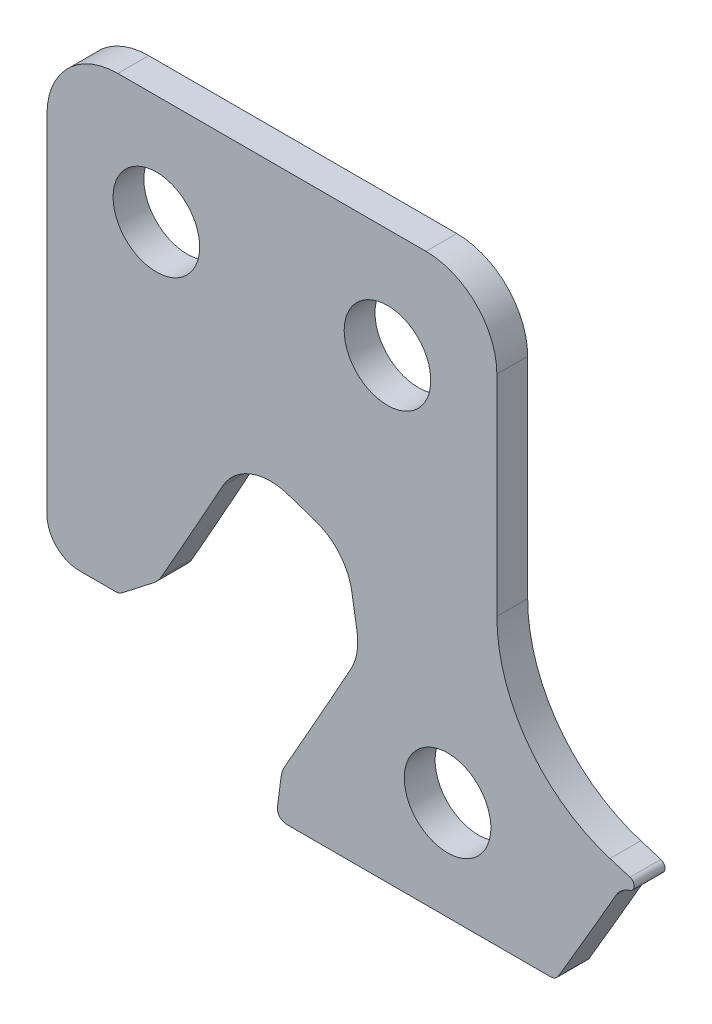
ISO-10303-21;
HEADER;
FILE_DESCRIPTION(('STEP AP214'),'2;1');
FILE_NAME('part.step','',(''),(''),'','','');
FILE_SCHEMA(('AUTOMOTIVE_DESIGN { 1 0 10303 214 1 1 1 1 }'));
ENDSEC;
DATA;
#1=APPLICATION_CONTEXT('core data for automotive mechanical design processes');
#2=APPLICATION_PROTOCOL_DEFINITION('international standard','automotive_design',2000,#1);
#3=PRODUCT_CONTEXT('',#1,'mechanical');
#4=PRODUCT('Part','Part','',(#3));
#5=PRODUCT_RELATED_PRODUCT_CATEGORY('part','',(#4));
#6=PRODUCT_DEFINITION_FORMATION('','',#4);
#7=PRODUCT_DEFINITION_CONTEXT('part definition',#1,'design');
#8=PRODUCT_DEFINITION('design','',#6,#7);
#9=PRODUCT_DEFINITION_SHAPE('','',#8);
#10=(LENGTH_UNIT() NAMED_UNIT(*) SI_UNIT(.MILLI.,.METRE.));
#11=(NAMED_UNIT(*) PLANE_ANGLE_UNIT() SI_UNIT($,.RADIAN.));
#12=(NAMED_UNIT(*) SI_UNIT($,.STERADIAN.) SOLID_ANGLE_UNIT());
#13=UNCERTAINTY_MEASURE_WITH_UNIT(LENGTH_MEASURE(1.E-05),#10,'distance_accuracy_value','');
#14=(GEOMETRIC_REPRESENTATION_CONTEXT(3) GLOBAL_UNCERTAINTY_ASSIGNED_CONTEXT((#13)) GLOBAL_UNIT_ASSIGNED_CONTEXT((#10,
#11,#12)) REPRESENTATION_CONTEXT('',''));
#15=CARTESIAN_POINT('',(0.,0.,0.));
#16=DIRECTION('',(0.,0.,1.));
#17=DIRECTION('',(1.,0.,0.));
#18=AXIS2_PLACEMENT_3D('',#15,#16,#17);
#19=CARTESIAN_POINT('',(-965.862080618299,58.123461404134,-2.54));
#20=DIRECTION('',(0.,0.,1.));
#21=DIRECTION('',(1.,0.,0.));
#22=AXIS2_PLACEMENT_3D('',#19,#20,#21);
#23=PLANE('',#22);
#24=CARTESIAN_POINT('',(-974.344,65.532,-2.54));
#25=DIRECTION('',(0.,0.,-1.));
#26=DIRECTION('',(-1.,0.,0.));
#27=AXIS2_PLACEMENT_3D('',#24,#25,#26);
#28=CIRCLE('',#27,3.56869999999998);
#29=CARTESIAN_POINT('',(-977.9127,65.532,-2.54));
#30=VERTEX_POINT('',#29);
#31=EDGE_CURVE('E490',#30,#30,#28,.T.);
#32=ORIENTED_EDGE('',*,*,#31,.F.);
#33=EDGE_LOOP('',(#32));
#34=FACE_BOUND('',#33,.T.);
#35=CARTESIAN_POINT('',(-979.297000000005,94.996,-2.54));
#36=DIRECTION('',(0.,0.,-1.));
#37=DIRECTION('',(-1.,0.,0.));
#38=AXIS2_PLACEMENT_3D('',#35,#36,#37);
#39=CIRCLE('',#38,3.56869999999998);
#40=CARTESIAN_POINT('',(-982.865700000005,94.996,-2.54));
#41=VERTEX_POINT('',#40);
#42=EDGE_CURVE('E498',#41,#41,#39,.T.);
#43=ORIENTED_EDGE('',*,*,#42,.F.);
#44=EDGE_LOOP('',(#43));
#45=FACE_BOUND('',#44,.T.);
#46=CARTESIAN_POINT('',(-965.862080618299,58.123461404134,-2.54));
#47=DIRECTION('',(0.,0.,1.));
#48=DIRECTION('',(1.,0.,0.));
#49=AXIS2_PLACEMENT_3D('',#46,#47,#48);
#50=CIRCLE('',#49,0.762000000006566);
#51=CARTESIAN_POINT('',(-965.862080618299,57.3614614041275,-2.54));
#52=VERTEX_POINT('',#51);
#53=CARTESIAN_POINT('',(-965.205820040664,57.7362068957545,-2.54));
#54=VERTEX_POINT('',#53);
#55=EDGE_CURVE('E375',#52,#54,#50,.T.);
#56=ORIENTED_EDGE('',*,*,#55,.F.);
#57=DIRECTION('',(1.,0.,0.));
#58=VECTOR('',#57,1.);
#59=CARTESIAN_POINT('',(-987.611398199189,57.3614614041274,-2.54));
#60=LINE('',#59,#58);
#61=CARTESIAN_POINT('',(-987.611398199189,57.3614614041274,-2.54));
#62=VERTEX_POINT('',#61);
#63=EDGE_CURVE('E255',#62,#52,#60,.T.);
#64=ORIENTED_EDGE('',*,*,#63,.F.);
#65=CARTESIAN_POINT('',(-987.611398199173,58.123461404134,-2.54));
#66=DIRECTION('',(0.,0.,1.));
#67=DIRECTION('',(1.,0.,0.));
#68=AXIS2_PLACEMENT_3D('',#65,#66,#67);
#69=CIRCLE('',#68,0.762000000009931);
#70=CARTESIAN_POINT('',(-988.367071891,58.2214474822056,-2.54));
#71=VERTEX_POINT('',#70);
#72=EDGE_CURVE('E239',#71,#62,#69,.T.);
#73=ORIENTED_EDGE('',*,*,#72,.F.);
#74=DIRECTION('',(-0.128590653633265,-0.991697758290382,0.));
#75=VECTOR('',#74,1.);
#76=CARTESIAN_POINT('',(-988.071639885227,60.4998343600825,-2.54));
#77=LINE('',#76,#75);
#78=CARTESIAN_POINT('',(-988.071639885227,60.4998343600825,-2.54));
#79=VERTEX_POINT('',#78);
#80=EDGE_CURVE('E253',#79,#71,#77,.T.);
#81=ORIENTED_EDGE('',*,*,#80,.F.);
#82=CARTESIAN_POINT('',(-985.552727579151,60.17321409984,-2.54));
#83=DIRECTION('',(0.,0.,1.));
#84=DIRECTION('',(1.,0.,0.));
#85=AXIS2_PLACEMENT_3D('',#82,#83,#84);
#86=CIRCLE('',#85,2.54000000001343);
#87=CARTESIAN_POINT('',(-987.757975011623,61.4335647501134,-2.54));
#88=VERTEX_POINT('',#87);
#89=EDGE_CURVE('E260',#88,#79,#86,.T.);
#90=ORIENTED_EDGE('',*,*,#89,.F.);
#91=CARTESIAN_POINT('',(-1733.41846147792,487.596028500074,-2.54));
#92=DIRECTION('',(0.,0.,-1.));
#93=DIRECTION('',(1.,0.,0.));
#94=AXIS2_PLACEMENT_3D('',#91,#92,#93);
#95=CIRCLE('',#94,858.85039825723);
#96=CARTESIAN_POINT('',(-982.309033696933,71.1123744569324,-2.54));
#97=VERTEX_POINT('',#96);
#98=EDGE_CURVE('E264',#97,#88,#95,.T.);
#99=ORIENTED_EDGE('',*,*,#98,.F.);
#100=CARTESIAN_POINT('',(-986.251514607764,73.2984458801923,-2.54));
#101=DIRECTION('',(0.,0.,-1.));
#102=DIRECTION('',(1.,0.,0.));
#103=AXIS2_PLACEMENT_3D('',#100,#101,#102);
#104=CIRCLE('',#103,4.50799999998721);
#105=CARTESIAN_POINT('',(-981.803276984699,74.0300509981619,-2.54));
#106=VERTEX_POINT('',#105);
#107=EDGE_CURVE('E593',#106,#97,#104,.T.);
#108=ORIENTED_EDGE('',*,*,#107,.F.);
#109=DIRECTION('',(0.162290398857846,-0.986743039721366,0.));
#110=VECTOR('',#109,1.);
#111=CARTESIAN_POINT('',(-982.238865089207,76.6784734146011,-2.54));
#112=LINE('',#111,#110);
#113=CARTESIAN_POINT('',(-982.238865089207,76.6784734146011,-2.54));
#114=VERTEX_POINT('',#113);
#115=EDGE_CURVE('E589',#114,#106,#112,.T.);
#116=ORIENTED_EDGE('',*,*,#115,.F.);
#117=CARTESIAN_POINT('',(-986.687102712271,75.9468682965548,-2.54));
#118=DIRECTION('',(0.,0.,-1.));
#119=DIRECTION('',(1.,0.,0.));
#120=AXIS2_PLACEMENT_3D('',#117,#118,#119);
#121=CIRCLE('',#120,4.50799999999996);
#122=CARTESIAN_POINT('',(-985.266924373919,80.2253209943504,-2.54));
#123=VERTEX_POINT('',#122);
#124=EDGE_CURVE('E585',#123,#114,#121,.T.);
#125=ORIENTED_EDGE('',*,*,#124,.F.);
#126=DIRECTION('',(0.949080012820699,-0.315035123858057,0.));
#127=VECTOR('',#126,1.);
#128=CARTESIAN_POINT('',(-987.523168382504,80.974252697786,-2.54));
#129=LINE('',#128,#127);
#130=CARTESIAN_POINT('',(-987.523168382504,80.974252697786,-2.54));
#131=VERTEX_POINT('',#130);
#132=EDGE_CURVE('E581',#131,#123,#129,.T.);
#133=ORIENTED_EDGE('',*,*,#132,.F.);
#134=CARTESIAN_POINT('',(-988.94334672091,76.6958000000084,-2.54));
#135=DIRECTION('',(0.,0.,-1.));
#136=DIRECTION('',(1.,0.,0.));
#137=AXIS2_PLACEMENT_3D('',#134,#135,#136);
#138=CIRCLE('',#137,4.50799999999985);
#139=CARTESIAN_POINT('',(-992.89010255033,78.8741439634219,-2.54));
#140=VERTEX_POINT('',#139);
#141=EDGE_CURVE('E577',#140,#131,#138,.T.);
#142=ORIENTED_EDGE('',*,*,#141,.F.);
#143=CARTESIAN_POINT('',(-1733.41846147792,487.596028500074,-2.54));
#144=DIRECTION('',(0.,0.,1.));
#145=DIRECTION('',(1.,0.,0.));
#146=AXIS2_PLACEMENT_3D('',#143,#144,#145);
#147=CIRCLE('',#146,845.834398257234);
#148=CARTESIAN_POINT('',(-997.92184081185,69.8873378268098,-2.54));
#149=VERTEX_POINT('',#148);
#150=EDGE_CURVE('E573',#149,#140,#147,.T.);
#151=ORIENTED_EDGE('',*,*,#150,.F.);
#152=CARTESIAN_POINT('',(-1000.13050177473,71.1416969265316,-2.54));
#153=DIRECTION('',(0.,0.,1.));
#154=DIRECTION('',(1.,0.,0.));
#155=AXIS2_PLACEMENT_3D('',#152,#153,#154);
#156=CIRCLE('',#155,2.53999999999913);
#157=CARTESIAN_POINT('',(-998.567958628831,69.1391837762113,-2.54));
#158=VERTEX_POINT('',#157);
#159=EDGE_CURVE('E569',#158,#149,#156,.T.);
#160=ORIENTED_EDGE('',*,*,#159,.F.);
#161=DIRECTION('',(0.788391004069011,0.615174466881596,0.));
#162=VECTOR('',#161,1.);
#163=CARTESIAN_POINT('',(-1001.19382194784,67.0902460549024,-2.54));
#164=LINE('',#163,#162);
#165=CARTESIAN_POINT('',(-1001.19382194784,67.0902460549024,-2.54));
#166=VERTEX_POINT('',#165);
#167=EDGE_CURVE('E565',#166,#158,#164,.T.);
#168=ORIENTED_EDGE('',*,*,#167,.F.);
#169=CARTESIAN_POINT('',(-1001.66258489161,67.691,-2.54));
#170=DIRECTION('',(0.,0.,1.));
#171=DIRECTION('',(1.,0.,0.));
#172=AXIS2_PLACEMENT_3D('',#169,#170,#171);
#173=CIRCLE('',#172,0.761999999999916);
#174=CARTESIAN_POINT('',(-1001.66258489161,66.9290000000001,-2.54));
#175=VERTEX_POINT('',#174);
#176=EDGE_CURVE('E561',#175,#166,#173,.T.);
#177=ORIENTED_EDGE('',*,*,#176,.F.);
#178=DIRECTION('',(1.,0.,0.));
#179=VECTOR('',#178,1.);
#180=CARTESIAN_POINT('',(-1004.697,66.929,-2.54));
#181=LINE('',#180,#179);
#182=CARTESIAN_POINT('',(-1004.697,66.929,-2.54));
#183=VERTEX_POINT('',#182);
#184=EDGE_CURVE('E557',#183,#175,#181,.T.);
#185=ORIENTED_EDGE('',*,*,#184,.F.);
#186=CARTESIAN_POINT('',(-1004.697,69.596,-2.54));
#187=DIRECTION('',(0.,0.,1.));
#188=DIRECTION('',(1.,0.,0.));
#189=AXIS2_PLACEMENT_3D('',#186,#187,#188);
#190=CIRCLE('',#189,2.66699999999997);
#191=CARTESIAN_POINT('',(-1007.364,69.596,-2.54));
#192=VERTEX_POINT('',#191);
#193=EDGE_CURVE('E553',#192,#183,#190,.T.);
#194=ORIENTED_EDGE('',*,*,#193,.F.);
#195=DIRECTION('',(0.,-1.,0.));
#196=VECTOR('',#195,1.);
#197=CARTESIAN_POINT('',(-1007.364,98.1709999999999,-2.54));
#198=LINE('',#197,#196);
#199=CARTESIAN_POINT('',(-1007.364,98.1709999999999,-2.54));
#200=VERTEX_POINT('',#199);
#201=EDGE_CURVE('E549',#200,#192,#198,.T.);
#202=ORIENTED_EDGE('',*,*,#201,.F.);
#203=CARTESIAN_POINT('',(-1001.522,98.171,-2.54));
#204=DIRECTION('',(0.,0.,1.));
#205=DIRECTION('',(1.,0.,0.));
#206=AXIS2_PLACEMENT_3D('',#203,#204,#205);
#207=CIRCLE('',#206,5.84200000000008);
#208=CARTESIAN_POINT('',(-1001.522,104.013,-2.54));
#209=VERTEX_POINT('',#208);
#210=EDGE_CURVE('E545',#209,#200,#207,.T.);
#211=ORIENTED_EDGE('',*,*,#210,.F.);
#212=DIRECTION('',(-1.,0.,0.));
#213=VECTOR('',#212,1.);
#214=CARTESIAN_POINT('',(-976.122,104.013,-2.54));
#215=LINE('',#214,#213);
#216=CARTESIAN_POINT('',(-976.122,104.013,-2.54));
#217=VERTEX_POINT('',#216);
#218=EDGE_CURVE('E541',#217,#209,#215,.T.);
#219=ORIENTED_EDGE('',*,*,#218,.F.);
#220=CARTESIAN_POINT('',(-976.122,98.171,-2.54));
#221=DIRECTION('',(0.,0.,1.));
#222=DIRECTION('',(1.,0.,0.));
#223=AXIS2_PLACEMENT_3D('',#220,#221,#222);
#224=CIRCLE('',#223,5.842);
#225=CARTESIAN_POINT('',(-970.28,98.1709999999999,-2.54));
#226=VERTEX_POINT('',#225);
#227=EDGE_CURVE('E537',#226,#217,#224,.T.);
#228=ORIENTED_EDGE('',*,*,#227,.F.);
#229=DIRECTION('',(2.05435062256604E-13,1.,0.));
#230=VECTOR('',#229,1.);
#231=CARTESIAN_POINT('',(-970.280000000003,80.877390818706,-2.54));
#232=LINE('',#231,#230);
#233=CARTESIAN_POINT('',(-970.280000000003,80.877390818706,-2.54));
#234=VERTEX_POINT('',#233);
#235=EDGE_CURVE('E533',#234,#226,#232,.T.);
#236=ORIENTED_EDGE('',*,*,#235,.F.);
#237=CARTESIAN_POINT('',(-957.072,80.8773908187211,-2.54));
#238=DIRECTION('',(0.,0.,-1.));
#239=DIRECTION('',(1.,0.,0.));
#240=AXIS2_PLACEMENT_3D('',#237,#238,#239);
#241=CIRCLE('',#240,13.2080000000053);
#242=CARTESIAN_POINT('',(-960.955669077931,68.2532718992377,-2.54));
#243=VERTEX_POINT('',#242);
#244=EDGE_CURVE('E529',#243,#234,#241,.T.);
#245=ORIENTED_EDGE('',*,*,#244,.F.);
#246=DIRECTION('',(-0.955793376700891,0.294039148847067,0.));
#247=VECTOR('',#246,1.);
#248=CARTESIAN_POINT('',(-959.30460257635,67.7453397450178,-2.54));
#249=LINE('',#248,#247);
#250=CARTESIAN_POINT('',(-959.30460257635,67.7453397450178,-2.54));
#251=VERTEX_POINT('',#250);
#252=EDGE_CURVE('E525',#251,#243,#249,.T.);
#253=ORIENTED_EDGE('',*,*,#252,.F.);
#254=CARTESIAN_POINT('',(-959.44926983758,67.2750894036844,-2.54));
#255=DIRECTION('',(0.,0.,1.));
#256=DIRECTION('',(1.,0.,0.));
#257=AXIS2_PLACEMENT_3D('',#254,#255,#256);
#258=CIRCLE('',#257,0.491999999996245);
#259=CARTESIAN_POINT('',(-959.303437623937,66.8051990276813,-2.54));
#260=VERTEX_POINT('',#259);
#261=EDGE_CURVE('E521',#260,#251,#258,.T.);
#262=ORIENTED_EDGE('',*,*,#261,.F.);
#263=CARTESIAN_POINT('',(-958.70113872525,64.8645135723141,-2.54));
#264=DIRECTION('',(0.,0.,-1.));
#265=DIRECTION('',(1.,0.,0.));
#266=AXIS2_PLACEMENT_3D('',#263,#264,#265);
#267=CIRCLE('',#266,2.03200000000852);
#268=CARTESIAN_POINT('',(-960.462561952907,65.8776336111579,-2.54));
#269=VERTEX_POINT('',#268);
#270=EDGE_CURVE('E517',#269,#260,#267,.T.);
#271=ORIENTED_EDGE('',*,*,#270,.F.);
#272=CARTESIAN_POINT('',(-1693.66746147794,487.596028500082,-2.54));
#273=DIRECTION('',(0.,0.,1.));
#274=DIRECTION('',(1.,0.,0.));
#275=AXIS2_PLACEMENT_3D('',#272,#273,#274);
#276=CIRCLE('',#275,845.834398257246);
#277=EDGE_CURVE('E514',#54,#269,#276,.T.);
#278=ORIENTED_EDGE('',*,*,#277,.F.);
#279=EDGE_LOOP('',(#56,#64,#73,#81,#90,#99,#108,#116,#125,#133,#142,#151,#160,#168,#177,#185,
#194,#202,#211,#219,#228,#236,#245,#253,#262,#271,#278));
#280=FACE_BOUND('',#279,.T.);
#281=CARTESIAN_POINT('',(-998.347,94.996,-2.54));
#282=DIRECTION('',(0.,0.,-1.));
#283=DIRECTION('',(-1.,0.,0.));
#284=AXIS2_PLACEMENT_3D('',#281,#282,#283);
#285=CIRCLE('',#284,3.56869999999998);
#286=CARTESIAN_POINT('',(-1001.9157,94.996,-2.54));
#287=VERTEX_POINT('',#286);
#288=EDGE_CURVE('E275',#287,#287,#285,.T.);
#289=ORIENTED_EDGE('',*,*,#288,.F.);
#290=EDGE_LOOP('',(#289));
#291=FACE_BOUND('',#290,.T.);
#292=ADVANCED_FACE('F51',(#34,#45,#280,#291),#23,.F.);
#293=CARTESIAN_POINT('',(-965.862080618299,58.123461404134,0.));
#294=DIRECTION('',(0.,0.,1.));
#295=DIRECTION('',(1.,0.,0.));
#296=AXIS2_PLACEMENT_3D('',#293,#294,#295);
#297=PLANE('',#296);
#298=CARTESIAN_POINT('',(-974.344,65.532,0.));
#299=DIRECTION('',(0.,0.,-1.));
#300=DIRECTION('',(-1.,0.,0.));
#301=AXIS2_PLACEMENT_3D('',#298,#299,#300);
#302=CIRCLE('',#301,3.56869999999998);
#303=CARTESIAN_POINT('',(-977.9127,65.532,0.));
#304=VERTEX_POINT('',#303);
#305=EDGE_CURVE('E488',#304,#304,#302,.T.);
#306=ORIENTED_EDGE('',*,*,#305,.T.);
#307=EDGE_LOOP('',(#306));
#308=FACE_BOUND('',#307,.T.);
#309=CARTESIAN_POINT('',(-979.297000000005,94.996,0.));
#310=DIRECTION('',(0.,0.,-1.));
#311=DIRECTION('',(-1.,0.,0.));
#312=AXIS2_PLACEMENT_3D('',#309,#310,#311);
#313=CIRCLE('',#312,3.56869999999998);
#314=CARTESIAN_POINT('',(-982.865700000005,94.996,0.));
#315=VERTEX_POINT('',#314);
#316=EDGE_CURVE('E492',#315,#315,#313,.T.);
#317=ORIENTED_EDGE('',*,*,#316,.T.);
#318=EDGE_LOOP('',(#317));
#319=FACE_BOUND('',#318,.T.);
#320=CARTESIAN_POINT('',(-965.862080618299,58.123461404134,0.));
#321=DIRECTION('',(0.,0.,1.));
#322=DIRECTION('',(1.,0.,0.));
#323=AXIS2_PLACEMENT_3D('',#320,#321,#322);
#324=CIRCLE('',#323,0.762000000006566);
#325=CARTESIAN_POINT('',(-965.862080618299,57.3614614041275,0.));
#326=VERTEX_POINT('',#325);
#327=CARTESIAN_POINT('',(-965.205820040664,57.7362068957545,0.));
#328=VERTEX_POINT('',#327);
#329=EDGE_CURVE('E270',#326,#328,#324,.T.);
#330=ORIENTED_EDGE('',*,*,#329,.T.);
#331=CARTESIAN_POINT('',(-1693.66746147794,487.596028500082,0.));
#332=DIRECTION('',(0.,0.,1.));
#333=DIRECTION('',(1.,0.,0.));
#334=AXIS2_PLACEMENT_3D('',#331,#332,#333);
#335=CIRCLE('',#334,845.834398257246);
#336=CARTESIAN_POINT('',(-960.462561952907,65.8776336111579,0.));
#337=VERTEX_POINT('',#336);
#338=EDGE_CURVE('E274',#328,#337,#335,.T.);
#339=ORIENTED_EDGE('',*,*,#338,.T.);
#340=CARTESIAN_POINT('',(-958.70113872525,64.8645135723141,0.));
#341=DIRECTION('',(0.,0.,-1.));
#342=DIRECTION('',(1.,0.,0.));
#343=AXIS2_PLACEMENT_3D('',#340,#341,#342);
#344=CIRCLE('',#343,2.03200000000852);
#345=CARTESIAN_POINT('',(-959.303437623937,66.8051990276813,0.));
#346=VERTEX_POINT('',#345);
#347=EDGE_CURVE('E279',#337,#346,#344,.T.);
#348=ORIENTED_EDGE('',*,*,#347,.T.);
#349=CARTESIAN_POINT('',(-959.44926983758,67.2750894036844,0.));
#350=DIRECTION('',(0.,0.,1.));
#351=DIRECTION('',(1.,0.,0.));
#352=AXIS2_PLACEMENT_3D('',#349,#350,#351);
#353=CIRCLE('',#352,0.491999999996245);
#354=CARTESIAN_POINT('',(-959.30460257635,67.7453397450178,0.));
#355=VERTEX_POINT('',#354);
#356=EDGE_CURVE('E283',#346,#355,#353,.T.);
#357=ORIENTED_EDGE('',*,*,#356,.T.);
#358=DIRECTION('',(-0.955793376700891,0.294039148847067,0.));
#359=VECTOR('',#358,1.);
#360=CARTESIAN_POINT('',(-959.30460257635,67.7453397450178,0.));
#361=LINE('',#360,#359);
#362=CARTESIAN_POINT('',(-960.955669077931,68.2532718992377,0.));
#363=VERTEX_POINT('',#362);
#364=EDGE_CURVE('E287',#355,#363,#361,.T.);
#365=ORIENTED_EDGE('',*,*,#364,.T.);
#366=CARTESIAN_POINT('',(-957.072,80.8773908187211,0.));
#367=DIRECTION('',(0.,0.,-1.));
#368=DIRECTION('',(1.,0.,0.));
#369=AXIS2_PLACEMENT_3D('',#366,#367,#368);
#370=CIRCLE('',#369,13.2080000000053);
#371=CARTESIAN_POINT('',(-970.280000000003,80.877390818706,0.));
#372=VERTEX_POINT('',#371);
#373=EDGE_CURVE('E291',#363,#372,#370,.T.);
#374=ORIENTED_EDGE('',*,*,#373,.T.);
#375=DIRECTION('',(2.05435062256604E-13,1.,0.));
#376=VECTOR('',#375,1.);
#377=CARTESIAN_POINT('',(-970.280000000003,80.877390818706,0.));
#378=LINE('',#377,#376);
#379=CARTESIAN_POINT('',(-970.28,98.1709999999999,0.));
#380=VERTEX_POINT('',#379);
#381=EDGE_CURVE('E295',#372,#380,#378,.T.);
#382=ORIENTED_EDGE('',*,*,#381,.T.);
#383=CARTESIAN_POINT('',(-976.122,98.171,0.));
#384=DIRECTION('',(0.,0.,1.));
#385=DIRECTION('',(1.,0.,0.));
#386=AXIS2_PLACEMENT_3D('',#383,#384,#385);
#387=CIRCLE('',#386,5.842);
#388=CARTESIAN_POINT('',(-976.122,104.013,0.));
#389=VERTEX_POINT('',#388);
#390=EDGE_CURVE('E299',#380,#389,#387,.T.);
#391=ORIENTED_EDGE('',*,*,#390,.T.);
#392=DIRECTION('',(-1.,0.,0.));
#393=VECTOR('',#392,1.);
#394=CARTESIAN_POINT('',(-976.122,104.013,0.));
#395=LINE('',#394,#393);
#396=CARTESIAN_POINT('',(-1001.522,104.013,0.));
#397=VERTEX_POINT('',#396);
#398=EDGE_CURVE('E303',#389,#397,#395,.T.);
#399=ORIENTED_EDGE('',*,*,#398,.T.);
#400=CARTESIAN_POINT('',(-1001.522,98.171,0.));
#401=DIRECTION('',(0.,0.,1.));
#402=DIRECTION('',(1.,0.,0.));
#403=AXIS2_PLACEMENT_3D('',#400,#401,#402);
#404=CIRCLE('',#403,5.84200000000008);
#405=CARTESIAN_POINT('',(-1007.364,98.1709999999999,0.));
#406=VERTEX_POINT('',#405);
#407=EDGE_CURVE('E307',#397,#406,#404,.T.);
#408=ORIENTED_EDGE('',*,*,#407,.T.);
#409=DIRECTION('',(0.,-1.,0.));
#410=VECTOR('',#409,1.);
#411=CARTESIAN_POINT('',(-1007.364,98.1709999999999,0.));
#412=LINE('',#411,#410);
#413=CARTESIAN_POINT('',(-1007.364,69.596,0.));
#414=VERTEX_POINT('',#413);
#415=EDGE_CURVE('E311',#406,#414,#412,.T.);
#416=ORIENTED_EDGE('',*,*,#415,.T.);
#417=CARTESIAN_POINT('',(-1004.697,69.596,0.));
#418=DIRECTION('',(0.,0.,1.));
#419=DIRECTION('',(1.,0.,0.));
#420=AXIS2_PLACEMENT_3D('',#417,#418,#419);
#421=CIRCLE('',#420,2.66699999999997);
#422=CARTESIAN_POINT('',(-1004.697,66.929,0.));
#423=VERTEX_POINT('',#422);
#424=EDGE_CURVE('E315',#414,#423,#421,.T.);
#425=ORIENTED_EDGE('',*,*,#424,.T.);
#426=DIRECTION('',(1.,0.,0.));
#427=VECTOR('',#426,1.);
#428=CARTESIAN_POINT('',(-1004.697,66.929,0.));
#429=LINE('',#428,#427);
#430=CARTESIAN_POINT('',(-1001.66258489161,66.9290000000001,0.));
#431=VERTEX_POINT('',#430);
#432=EDGE_CURVE('E319',#423,#431,#429,.T.);
#433=ORIENTED_EDGE('',*,*,#432,.T.);
#434=CARTESIAN_POINT('',(-1001.66258489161,67.691,0.));
#435=DIRECTION('',(0.,0.,1.));
#436=DIRECTION('',(1.,0.,0.));
#437=AXIS2_PLACEMENT_3D('',#434,#435,#436);
#438=CIRCLE('',#437,0.761999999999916);
#439=CARTESIAN_POINT('',(-1001.19382194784,67.0902460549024,0.));
#440=VERTEX_POINT('',#439);
#441=EDGE_CURVE('E323',#431,#440,#438,.T.);
#442=ORIENTED_EDGE('',*,*,#441,.T.);
#443=DIRECTION('',(0.788391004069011,0.615174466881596,0.));
#444=VECTOR('',#443,1.);
#445=CARTESIAN_POINT('',(-1001.19382194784,67.0902460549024,0.));
#446=LINE('',#445,#444);
#447=CARTESIAN_POINT('',(-998.567958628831,69.1391837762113,0.));
#448=VERTEX_POINT('',#447);
#449=EDGE_CURVE('E327',#440,#448,#446,.T.);
#450=ORIENTED_EDGE('',*,*,#449,.T.);
#451=CARTESIAN_POINT('',(-1000.13050177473,71.1416969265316,0.));
#452=DIRECTION('',(0.,0.,1.));
#453=DIRECTION('',(1.,0.,0.));
#454=AXIS2_PLACEMENT_3D('',#451,#452,#453);
#455=CIRCLE('',#454,2.53999999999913);
#456=CARTESIAN_POINT('',(-997.92184081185,69.8873378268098,0.));
#457=VERTEX_POINT('',#456);
#458=EDGE_CURVE('E331',#448,#457,#455,.T.);
#459=ORIENTED_EDGE('',*,*,#458,.T.);
#460=CARTESIAN_POINT('',(-1733.41846147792,487.596028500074,0.));
#461=DIRECTION('',(0.,0.,1.));
#462=DIRECTION('',(1.,0.,0.));
#463=AXIS2_PLACEMENT_3D('',#460,#461,#462);
#464=CIRCLE('',#463,845.834398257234);
#465=CARTESIAN_POINT('',(-992.89010255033,78.8741439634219,0.));
#466=VERTEX_POINT('',#465);
#467=EDGE_CURVE('E335',#457,#466,#464,.T.);
#468=ORIENTED_EDGE('',*,*,#467,.T.);
#469=CARTESIAN_POINT('',(-988.94334672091,76.6958000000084,0.));
#470=DIRECTION('',(0.,0.,-1.));
#471=DIRECTION('',(1.,0.,0.));
#472=AXIS2_PLACEMENT_3D('',#469,#470,#471);
#473=CIRCLE('',#472,4.50799999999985);
#474=CARTESIAN_POINT('',(-987.523168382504,80.974252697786,0.));
#475=VERTEX_POINT('',#474);
#476=EDGE_CURVE('E339',#466,#475,#473,.T.);
#477=ORIENTED_EDGE('',*,*,#476,.T.);
#478=DIRECTION('',(0.949080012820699,-0.315035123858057,0.));
#479=VECTOR('',#478,1.);
#480=CARTESIAN_POINT('',(-987.523168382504,80.974252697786,0.));
#481=LINE('',#480,#479);
#482=CARTESIAN_POINT('',(-985.266924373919,80.2253209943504,0.));
#483=VERTEX_POINT('',#482);
#484=EDGE_CURVE('E343',#475,#483,#481,.T.);
#485=ORIENTED_EDGE('',*,*,#484,.T.);
#486=CARTESIAN_POINT('',(-986.687102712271,75.9468682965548,0.));
#487=DIRECTION('',(0.,0.,-1.));
#488=DIRECTION('',(1.,0.,0.));
#489=AXIS2_PLACEMENT_3D('',#486,#487,#488);
#490=CIRCLE('',#489,4.50799999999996);
#491=CARTESIAN_POINT('',(-982.238865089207,76.6784734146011,0.));
#492=VERTEX_POINT('',#491);
#493=EDGE_CURVE('E347',#483,#492,#490,.T.);
#494=ORIENTED_EDGE('',*,*,#493,.T.);
#495=DIRECTION('',(0.162290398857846,-0.986743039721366,0.));
#496=VECTOR('',#495,1.);
#497=CARTESIAN_POINT('',(-982.238865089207,76.6784734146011,0.));
#498=LINE('',#497,#496);
#499=CARTESIAN_POINT('',(-981.803276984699,74.0300509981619,0.));
#500=VERTEX_POINT('',#499);
#501=EDGE_CURVE('E351',#492,#500,#498,.T.);
#502=ORIENTED_EDGE('',*,*,#501,.T.);
#503=CARTESIAN_POINT('',(-986.251514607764,73.2984458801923,0.));
#504=DIRECTION('',(0.,0.,-1.));
#505=DIRECTION('',(1.,0.,0.));
#506=AXIS2_PLACEMENT_3D('',#503,#504,#505);
#507=CIRCLE('',#506,4.50799999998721);
#508=CARTESIAN_POINT('',(-982.309033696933,71.1123744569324,0.));
#509=VERTEX_POINT('',#508);
#510=EDGE_CURVE('E355',#500,#509,#507,.T.);
#511=ORIENTED_EDGE('',*,*,#510,.T.);
#512=CARTESIAN_POINT('',(-1733.41846147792,487.596028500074,0.));
#513=DIRECTION('',(0.,0.,-1.));
#514=DIRECTION('',(1.,0.,0.));
#515=AXIS2_PLACEMENT_3D('',#512,#513,#514);
#516=CIRCLE('',#515,858.85039825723);
#517=CARTESIAN_POINT('',(-987.757975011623,61.4335647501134,0.));
#518=VERTEX_POINT('',#517);
#519=EDGE_CURVE('E359',#509,#518,#516,.T.);
#520=ORIENTED_EDGE('',*,*,#519,.T.);
#521=CARTESIAN_POINT('',(-985.552727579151,60.17321409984,0.));
#522=DIRECTION('',(0.,0.,1.));
#523=DIRECTION('',(1.,0.,0.));
#524=AXIS2_PLACEMENT_3D('',#521,#522,#523);
#525=CIRCLE('',#524,2.54000000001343);
#526=CARTESIAN_POINT('',(-988.071639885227,60.4998343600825,0.));
#527=VERTEX_POINT('',#526);
#528=EDGE_CURVE('E363',#518,#527,#525,.T.);
#529=ORIENTED_EDGE('',*,*,#528,.T.);
#530=DIRECTION('',(-0.128590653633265,-0.991697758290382,0.));
#531=VECTOR('',#530,1.);
#532=CARTESIAN_POINT('',(-988.071639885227,60.4998343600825,0.));
#533=LINE('',#532,#531);
#534=CARTESIAN_POINT('',(-988.367071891,58.2214474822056,0.));
#535=VERTEX_POINT('',#534);
#536=EDGE_CURVE('E367',#527,#535,#533,.T.);
#537=ORIENTED_EDGE('',*,*,#536,.T.);
#538=CARTESIAN_POINT('',(-987.611398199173,58.123461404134,0.));
#539=DIRECTION('',(0.,0.,1.));
#540=DIRECTION('',(1.,0.,0.));
#541=AXIS2_PLACEMENT_3D('',#538,#539,#540);
#542=CIRCLE('',#541,0.762000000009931);
#543=CARTESIAN_POINT('',(-987.611398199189,57.3614614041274,0.));
#544=VERTEX_POINT('',#543);
#545=EDGE_CURVE('E241',#535,#544,#542,.T.);
#546=ORIENTED_EDGE('',*,*,#545,.T.);
#547=DIRECTION('',(1.,0.,0.));
#548=VECTOR('',#547,1.);
#549=CARTESIAN_POINT('',(-987.611398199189,57.3614614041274,0.));
#550=LINE('',#549,#548);
#551=EDGE_CURVE('E372',#544,#326,#550,.T.);
#552=ORIENTED_EDGE('',*,*,#551,.T.);
#553=EDGE_LOOP('',(#330,#339,#348,#357,#365,#374,#382,#391,#399,#408,#416,#425,#433,#442,#450,
#459,#468,#477,#485,#494,#502,#511,#520,#529,#537,#546,#552));
#554=FACE_BOUND('',#553,.T.);
#555=CARTESIAN_POINT('',(-998.347,94.996,0.));
#556=DIRECTION('',(0.,0.,-1.));
#557=DIRECTION('',(-1.,0.,0.));
#558=AXIS2_PLACEMENT_3D('',#555,#556,#557);
#559=CIRCLE('',#558,3.56869999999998);
#560=CARTESIAN_POINT('',(-1001.9157,94.996,0.));
#561=VERTEX_POINT('',#560);
#562=EDGE_CURVE('E505',#561,#561,#559,.T.);
#563=ORIENTED_EDGE('',*,*,#562,.T.);
#564=EDGE_LOOP('',(#563));
#565=FACE_BOUND('',#564,.T.);
#566=ADVANCED_FACE('F451',(#308,#319,#554,#565),#297,.T.);
#567=CARTESIAN_POINT('',(-965.862080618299,58.123461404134,-2.54));
#568=DIRECTION('',(0.,0.,1.));
#569=DIRECTION('',(1.,0.,0.));
#570=AXIS2_PLACEMENT_3D('',#567,#568,#569);
#571=CYLINDRICAL_SURFACE('',#570,0.762000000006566);
#572=ORIENTED_EDGE('',*,*,#329,.F.);
#573=DIRECTION('',(0.,0.,1.));
#574=VECTOR('',#573,1.);
#575=CARTESIAN_POINT('',(-965.862080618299,57.3614614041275,-2.54));
#576=LINE('',#575,#574);
#577=EDGE_CURVE('E11',#52,#326,#576,.T.);
#578=ORIENTED_EDGE('',*,*,#577,.F.);
#579=ORIENTED_EDGE('',*,*,#55,.T.);
#580=DIRECTION('',(0.,0.,1.));
#581=VECTOR('',#580,1.);
#582=CARTESIAN_POINT('',(-965.205820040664,57.7362068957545,-2.54));
#583=LINE('',#582,#581);
#584=EDGE_CURVE('E55',#54,#328,#583,.T.);
#585=ORIENTED_EDGE('',*,*,#584,.T.);
#586=EDGE_LOOP('',(#572,#578,#579,#585));
#587=FACE_BOUND('',#586,.T.);
#588=ADVANCED_FACE('F53',(#587),#571,.T.);
#589=CARTESIAN_POINT('',(-987.611398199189,57.3614614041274,-2.54));
#590=DIRECTION('',(0.,-1.,0.));
#591=DIRECTION('',(1.,0.,0.));
#592=AXIS2_PLACEMENT_3D('',#589,#590,#591);
#593=PLANE('',#592);
#594=ORIENTED_EDGE('',*,*,#551,.F.);
#595=DIRECTION('',(0.,0.,1.));
#596=VECTOR('',#595,1.);
#597=CARTESIAN_POINT('',(-987.611398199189,57.3614614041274,-2.54));
#598=LINE('',#597,#596);
#599=EDGE_CURVE('E62',#62,#544,#598,.T.);
#600=ORIENTED_EDGE('',*,*,#599,.F.);
#601=ORIENTED_EDGE('',*,*,#63,.T.);
#602=ORIENTED_EDGE('',*,*,#577,.T.);
#603=EDGE_LOOP('',(#594,#600,#601,#602));
#604=FACE_BOUND('',#603,.T.);
#605=ADVANCED_FACE('F453',(#604),#593,.T.);
#606=CARTESIAN_POINT('',(-987.611398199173,58.123461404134,-2.54));
#607=DIRECTION('',(0.,0.,1.));
#608=DIRECTION('',(1.,0.,0.));
#609=AXIS2_PLACEMENT_3D('',#606,#607,#608);
#610=CYLINDRICAL_SURFACE('',#609,0.762000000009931);
#611=ORIENTED_EDGE('',*,*,#545,.F.);
#612=DIRECTION('',(0.,0.,1.));
#613=VECTOR('',#612,1.);
#614=CARTESIAN_POINT('',(-988.367071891,58.2214474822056,-2.54));
#615=LINE('',#614,#613);
#616=EDGE_CURVE('E236',#71,#535,#615,.T.);
#617=ORIENTED_EDGE('',*,*,#616,.F.);
#618=ORIENTED_EDGE('',*,*,#72,.T.);
#619=ORIENTED_EDGE('',*,*,#599,.T.);
#620=EDGE_LOOP('',(#611,#617,#618,#619));
#621=FACE_BOUND('',#620,.T.);
#622=ADVANCED_FACE('F238',(#621),#610,.T.);
#623=CARTESIAN_POINT('',(-988.071639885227,60.4998343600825,-2.54));
#624=DIRECTION('',(-0.991697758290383,0.128590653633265,0.));
#625=DIRECTION('',(-0.128590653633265,-0.991697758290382,0.));
#626=AXIS2_PLACEMENT_3D('',#623,#624,#625);
#627=PLANE('',#626);
#628=ORIENTED_EDGE('',*,*,#536,.F.);
#629=DIRECTION('',(0.,0.,1.));
#630=VECTOR('',#629,1.);
#631=CARTESIAN_POINT('',(-988.071639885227,60.4998343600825,-2.54));
#632=LINE('',#631,#630);
#633=EDGE_CURVE('E247',#79,#527,#632,.T.);
#634=ORIENTED_EDGE('',*,*,#633,.F.);
#635=ORIENTED_EDGE('',*,*,#80,.T.);
#636=ORIENTED_EDGE('',*,*,#616,.T.);
#637=EDGE_LOOP('',(#628,#634,#635,#636));
#638=FACE_BOUND('',#637,.T.);
#639=ADVANCED_FACE('F258',(#638),#627,.T.);
#640=CARTESIAN_POINT('',(-985.552727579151,60.17321409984,-2.54));
#641=DIRECTION('',(0.,0.,1.));
#642=DIRECTION('',(1.,0.,0.));
#643=AXIS2_PLACEMENT_3D('',#640,#641,#642);
#644=CYLINDRICAL_SURFACE('',#643,2.54000000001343);
#645=ORIENTED_EDGE('',*,*,#528,.F.);
#646=DIRECTION('',(0.,0.,1.));
#647=VECTOR('',#646,1.);
#648=CARTESIAN_POINT('',(-987.757975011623,61.4335647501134,-2.54));
#649=LINE('',#648,#647);
#650=EDGE_CURVE('E381',#88,#518,#649,.T.);
#651=ORIENTED_EDGE('',*,*,#650,.F.);
#652=ORIENTED_EDGE('',*,*,#89,.T.);
#653=ORIENTED_EDGE('',*,*,#633,.T.);
#654=EDGE_LOOP('',(#645,#651,#652,#653));
#655=FACE_BOUND('',#654,.T.);
#656=ADVANCED_FACE('F684',(#655),#644,.T.);
#657=CARTESIAN_POINT('',(-1733.41846147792,487.596028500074,-2.54));
#658=DIRECTION('',(0.,0.,1.));
#659=DIRECTION('',(1.,0.,0.));
#660=AXIS2_PLACEMENT_3D('',#657,#658,#659);
#661=CYLINDRICAL_SURFACE('',#660,858.85039825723);
#662=ORIENTED_EDGE('',*,*,#519,.F.);
#663=DIRECTION('',(0.,0.,1.));
#664=VECTOR('',#663,1.);
#665=CARTESIAN_POINT('',(-982.309033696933,71.1123744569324,-2.54));
#666=LINE('',#665,#664);
#667=EDGE_CURVE('E384',#97,#509,#666,.T.);
#668=ORIENTED_EDGE('',*,*,#667,.F.);
#669=ORIENTED_EDGE('',*,*,#98,.T.);
#670=ORIENTED_EDGE('',*,*,#650,.T.);
#671=EDGE_LOOP('',(#662,#668,#669,#670));
#672=FACE_BOUND('',#671,.T.);
#673=ADVANCED_FACE('F602',(#672),#661,.F.);
#674=CARTESIAN_POINT('',(-986.251514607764,73.2984458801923,-2.54));
#675=DIRECTION('',(0.,0.,1.));
#676=DIRECTION('',(1.,0.,0.));
#677=AXIS2_PLACEMENT_3D('',#674,#675,#676);
#678=CYLINDRICAL_SURFACE('',#677,4.50799999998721);
#679=ORIENTED_EDGE('',*,*,#510,.F.);
#680=DIRECTION('',(0.,0.,1.));
#681=VECTOR('',#680,1.);
#682=CARTESIAN_POINT('',(-981.803276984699,74.0300509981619,-2.54));
#683=LINE('',#682,#681);
#684=EDGE_CURVE('E387',#106,#500,#683,.T.);
#685=ORIENTED_EDGE('',*,*,#684,.F.);
#686=ORIENTED_EDGE('',*,*,#107,.T.);
#687=ORIENTED_EDGE('',*,*,#667,.T.);
#688=EDGE_LOOP('',(#679,#685,#686,#687));
#689=FACE_BOUND('',#688,.T.);
#690=ADVANCED_FACE('F608',(#689),#678,.F.);
#691=CARTESIAN_POINT('',(-982.238865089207,76.6784734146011,-2.54));
#692=DIRECTION('',(-0.986743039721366,-0.162290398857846,0.));
#693=DIRECTION('',(0.162290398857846,-0.986743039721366,0.));
#694=AXIS2_PLACEMENT_3D('',#691,#692,#693);
#695=PLANE('',#694);
#696=ORIENTED_EDGE('',*,*,#501,.F.);
#697=DIRECTION('',(0.,0.,1.));
#698=VECTOR('',#697,1.);
#699=CARTESIAN_POINT('',(-982.238865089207,76.6784734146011,-2.54));
#700=LINE('',#699,#698);
#701=EDGE_CURVE('E390',#114,#492,#700,.T.);
#702=ORIENTED_EDGE('',*,*,#701,.F.);
#703=ORIENTED_EDGE('',*,*,#115,.T.);
#704=ORIENTED_EDGE('',*,*,#684,.T.);
#705=EDGE_LOOP('',(#696,#702,#703,#704));
#706=FACE_BOUND('',#705,.T.);
#707=ADVANCED_FACE('F611',(#706),#695,.T.);
#708=CARTESIAN_POINT('',(-986.687102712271,75.9468682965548,-2.54));
#709=DIRECTION('',(0.,0.,1.));
#710=DIRECTION('',(1.,0.,0.));
#711=AXIS2_PLACEMENT_3D('',#708,#709,#710);
#712=CYLINDRICAL_SURFACE('',#711,4.50799999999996);
#713=ORIENTED_EDGE('',*,*,#493,.F.);
#714=DIRECTION('',(0.,0.,1.));
#715=VECTOR('',#714,1.);
#716=CARTESIAN_POINT('',(-985.266924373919,80.2253209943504,-2.54));
#717=LINE('',#716,#715);
#718=EDGE_CURVE('E393',#123,#483,#717,.T.);
#719=ORIENTED_EDGE('',*,*,#718,.F.);
#720=ORIENTED_EDGE('',*,*,#124,.T.);
#721=ORIENTED_EDGE('',*,*,#701,.T.);
#722=EDGE_LOOP('',(#713,#719,#720,#721));
#723=FACE_BOUND('',#722,.T.);
#724=ADVANCED_FACE('F616',(#723),#712,.F.);
#725=CARTESIAN_POINT('',(-987.523168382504,80.974252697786,-2.54));
#726=DIRECTION('',(-0.315035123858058,-0.949080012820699,0.));
#727=DIRECTION('',(0.949080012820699,-0.315035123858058,0.));
#728=AXIS2_PLACEMENT_3D('',#725,#726,#727);
#729=PLANE('',#728);
#730=ORIENTED_EDGE('',*,*,#484,.F.);
#731=DIRECTION('',(0.,0.,1.));
#732=VECTOR('',#731,1.);
#733=CARTESIAN_POINT('',(-987.523168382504,80.974252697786,-2.54));
#734=LINE('',#733,#732);
#735=EDGE_CURVE('E396',#131,#475,#734,.T.);
#736=ORIENTED_EDGE('',*,*,#735,.F.);
#737=ORIENTED_EDGE('',*,*,#132,.T.);
#738=ORIENTED_EDGE('',*,*,#718,.T.);
#739=EDGE_LOOP('',(#730,#736,#737,#738));
#740=FACE_BOUND('',#739,.T.);
#741=ADVANCED_FACE('F619',(#740),#729,.T.);
#742=CARTESIAN_POINT('',(-988.94334672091,76.6958000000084,-2.54));
#743=DIRECTION('',(0.,0.,1.));
#744=DIRECTION('',(1.,0.,0.));
#745=AXIS2_PLACEMENT_3D('',#742,#743,#744);
#746=CYLINDRICAL_SURFACE('',#745,4.50799999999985);
#747=ORIENTED_EDGE('',*,*,#476,.F.);
#748=DIRECTION('',(0.,0.,1.));
#749=VECTOR('',#748,1.);
#750=CARTESIAN_POINT('',(-992.89010255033,78.8741439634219,-2.54));
#751=LINE('',#750,#749);
#752=EDGE_CURVE('E399',#140,#466,#751,.T.);
#753=ORIENTED_EDGE('',*,*,#752,.F.);
#754=ORIENTED_EDGE('',*,*,#141,.T.);
#755=ORIENTED_EDGE('',*,*,#735,.T.);
#756=EDGE_LOOP('',(#747,#753,#754,#755));
#757=FACE_BOUND('',#756,.T.);
#758=ADVANCED_FACE('F624',(#757),#746,.F.);
#759=CARTESIAN_POINT('',(-1733.41846147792,487.596028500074,-2.54));
#760=DIRECTION('',(0.,0.,1.));
#761=DIRECTION('',(1.,0.,0.));
#762=AXIS2_PLACEMENT_3D('',#759,#760,#761);
#763=CYLINDRICAL_SURFACE('',#762,845.834398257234);
#764=ORIENTED_EDGE('',*,*,#467,.F.);
#765=DIRECTION('',(0.,0.,1.));
#766=VECTOR('',#765,1.);
#767=CARTESIAN_POINT('',(-997.92184081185,69.8873378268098,-2.54));
#768=LINE('',#767,#766);
#769=EDGE_CURVE('E402',#149,#457,#768,.T.);
#770=ORIENTED_EDGE('',*,*,#769,.F.);
#771=ORIENTED_EDGE('',*,*,#150,.T.);
#772=ORIENTED_EDGE('',*,*,#752,.T.);
#773=EDGE_LOOP('',(#764,#770,#771,#772));
#774=FACE_BOUND('',#773,.T.);
#775=ADVANCED_FACE('F627',(#774),#763,.T.);
#776=CARTESIAN_POINT('',(-1000.13050177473,71.1416969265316,-2.54));
#777=DIRECTION('',(0.,0.,1.));
#778=DIRECTION('',(1.,0.,0.));
#779=AXIS2_PLACEMENT_3D('',#776,#777,#778);
#780=CYLINDRICAL_SURFACE('',#779,2.53999999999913);
#781=ORIENTED_EDGE('',*,*,#458,.F.);
#782=DIRECTION('',(0.,0.,1.));
#783=VECTOR('',#782,1.);
#784=CARTESIAN_POINT('',(-998.567958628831,69.1391837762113,-2.54));
#785=LINE('',#784,#783);
#786=EDGE_CURVE('E405',#158,#448,#785,.T.);
#787=ORIENTED_EDGE('',*,*,#786,.F.);
#788=ORIENTED_EDGE('',*,*,#159,.T.);
#789=ORIENTED_EDGE('',*,*,#769,.T.);
#790=EDGE_LOOP('',(#781,#787,#788,#789));
#791=FACE_BOUND('',#790,.T.);
#792=ADVANCED_FACE('F632',(#791),#780,.T.);
#793=CARTESIAN_POINT('',(-1001.19382194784,67.0902460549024,-2.54));
#794=DIRECTION('',(0.615174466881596,-0.788391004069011,0.));
#795=DIRECTION('',(0.788391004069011,0.615174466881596,0.));
#796=AXIS2_PLACEMENT_3D('',#793,#794,#795);
#797=PLANE('',#796);
#798=ORIENTED_EDGE('',*,*,#449,.F.);
#799=DIRECTION('',(0.,0.,1.));
#800=VECTOR('',#799,1.);
#801=CARTESIAN_POINT('',(-1001.19382194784,67.0902460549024,-2.54));
#802=LINE('',#801,#800);
#803=EDGE_CURVE('E408',#166,#440,#802,.T.);
#804=ORIENTED_EDGE('',*,*,#803,.F.);
#805=ORIENTED_EDGE('',*,*,#167,.T.);
#806=ORIENTED_EDGE('',*,*,#786,.T.);
#807=EDGE_LOOP('',(#798,#804,#805,#806));
#808=FACE_BOUND('',#807,.T.);
#809=ADVANCED_FACE('F635',(#808),#797,.T.);
#810=CARTESIAN_POINT('',(-1001.66258489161,67.691,-2.54));
#811=DIRECTION('',(0.,0.,1.));
#812=DIRECTION('',(1.,0.,0.));
#813=AXIS2_PLACEMENT_3D('',#810,#811,#812);
#814=CYLINDRICAL_SURFACE('',#813,0.761999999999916);
#815=ORIENTED_EDGE('',*,*,#441,.F.);
#816=DIRECTION('',(0.,0.,1.));
#817=VECTOR('',#816,1.);
#818=CARTESIAN_POINT('',(-1001.66258489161,66.9290000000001,-2.54));
#819=LINE('',#818,#817);
#820=EDGE_CURVE('E411',#175,#431,#819,.T.);
#821=ORIENTED_EDGE('',*,*,#820,.F.);
#822=ORIENTED_EDGE('',*,*,#176,.T.);
#823=ORIENTED_EDGE('',*,*,#803,.T.);
#824=EDGE_LOOP('',(#815,#821,#822,#823));
#825=FACE_BOUND('',#824,.T.);
#826=ADVANCED_FACE('F640',(#825),#814,.T.);
#827=CARTESIAN_POINT('',(-1004.697,66.929,-2.54));
#828=DIRECTION('',(0.,-1.,0.));
#829=DIRECTION('',(0.,0.,-1.));
#830=AXIS2_PLACEMENT_3D('',#827,#828,#829);
#831=PLANE('',#830);
#832=ORIENTED_EDGE('',*,*,#432,.F.);
#833=DIRECTION('',(0.,0.,1.));
#834=VECTOR('',#833,1.);
#835=CARTESIAN_POINT('',(-1004.697,66.929,-2.54));
#836=LINE('',#835,#834);
#837=EDGE_CURVE('E414',#183,#423,#836,.T.);
#838=ORIENTED_EDGE('',*,*,#837,.F.);
#839=ORIENTED_EDGE('',*,*,#184,.T.);
#840=ORIENTED_EDGE('',*,*,#820,.T.);
#841=EDGE_LOOP('',(#832,#838,#839,#840));
#842=FACE_BOUND('',#841,.T.);
#843=ADVANCED_FACE('F643',(#842),#831,.T.);
#844=CARTESIAN_POINT('',(-1004.697,69.596,-2.54));
#845=DIRECTION('',(0.,0.,1.));
#846=DIRECTION('',(1.,0.,0.));
#847=AXIS2_PLACEMENT_3D('',#844,#845,#846);
#848=CYLINDRICAL_SURFACE('',#847,2.66699999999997);
#849=ORIENTED_EDGE('',*,*,#424,.F.);
#850=DIRECTION('',(0.,0.,1.));
#851=VECTOR('',#850,1.);
#852=CARTESIAN_POINT('',(-1007.364,69.596,-2.54));
#853=LINE('',#852,#851);
#854=EDGE_CURVE('E417',#192,#414,#853,.T.);
#855=ORIENTED_EDGE('',*,*,#854,.F.);
#856=ORIENTED_EDGE('',*,*,#193,.T.);
#857=ORIENTED_EDGE('',*,*,#837,.T.);
#858=EDGE_LOOP('',(#849,#855,#856,#857));
#859=FACE_BOUND('',#858,.T.);
#860=ADVANCED_FACE('F648',(#859),#848,.T.);
#861=CARTESIAN_POINT('',(-1007.364,98.1709999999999,-2.54));
#862=DIRECTION('',(-1.,0.,0.));
#863=DIRECTION('',(0.,-1.,0.));
#864=AXIS2_PLACEMENT_3D('',#861,#862,#863);
#865=PLANE('',#864);
#866=ORIENTED_EDGE('',*,*,#415,.F.);
#867=DIRECTION('',(0.,0.,1.));
#868=VECTOR('',#867,1.);
#869=CARTESIAN_POINT('',(-1007.364,98.1709999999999,-2.54));
#870=LINE('',#869,#868);
#871=EDGE_CURVE('E420',#200,#406,#870,.T.);
#872=ORIENTED_EDGE('',*,*,#871,.F.);
#873=ORIENTED_EDGE('',*,*,#201,.T.);
#874=ORIENTED_EDGE('',*,*,#854,.T.);
#875=EDGE_LOOP('',(#866,#872,#873,#874));
#876=FACE_BOUND('',#875,.T.);
#877=ADVANCED_FACE('F651',(#876),#865,.T.);
#878=CARTESIAN_POINT('',(-1001.522,98.171,-2.54));
#879=DIRECTION('',(0.,0.,1.));
#880=DIRECTION('',(1.,0.,0.));
#881=AXIS2_PLACEMENT_3D('',#878,#879,#880);
#882=CYLINDRICAL_SURFACE('',#881,5.84200000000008);
#883=ORIENTED_EDGE('',*,*,#407,.F.);
#884=DIRECTION('',(0.,0.,1.));
#885=VECTOR('',#884,1.);
#886=CARTESIAN_POINT('',(-1001.522,104.013,-2.54));
#887=LINE('',#886,#885);
#888=EDGE_CURVE('E423',#209,#397,#887,.T.);
#889=ORIENTED_EDGE('',*,*,#888,.F.);
#890=ORIENTED_EDGE('',*,*,#210,.T.);
#891=ORIENTED_EDGE('',*,*,#871,.T.);
#892=EDGE_LOOP('',(#883,#889,#890,#891));
#893=FACE_BOUND('',#892,.T.);
#894=ADVANCED_FACE('F656',(#893),#882,.T.);
#895=CARTESIAN_POINT('',(-976.122,104.013,-2.54));
#896=DIRECTION('',(0.,1.,0.));
#897=DIRECTION('',(-1.,0.,0.));
#898=AXIS2_PLACEMENT_3D('',#895,#896,#897);
#899=PLANE('',#898);
#900=ORIENTED_EDGE('',*,*,#398,.F.);
#901=DIRECTION('',(0.,0.,1.));
#902=VECTOR('',#901,1.);
#903=CARTESIAN_POINT('',(-976.122,104.013,-2.54));
#904=LINE('',#903,#902);
#905=EDGE_CURVE('E426',#217,#389,#904,.T.);
#906=ORIENTED_EDGE('',*,*,#905,.F.);
#907=ORIENTED_EDGE('',*,*,#218,.T.);
#908=ORIENTED_EDGE('',*,*,#888,.T.);
#909=EDGE_LOOP('',(#900,#906,#907,#908));
#910=FACE_BOUND('',#909,.T.);
#911=ADVANCED_FACE('F659',(#910),#899,.T.);
#912=CARTESIAN_POINT('',(-976.122,98.171,-2.54));
#913=DIRECTION('',(0.,0.,1.));
#914=DIRECTION('',(1.,0.,0.));
#915=AXIS2_PLACEMENT_3D('',#912,#913,#914);
#916=CYLINDRICAL_SURFACE('',#915,5.842);
#917=ORIENTED_EDGE('',*,*,#390,.F.);
#918=DIRECTION('',(0.,0.,1.));
#919=VECTOR('',#918,1.);
#920=CARTESIAN_POINT('',(-970.28,98.1709999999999,-2.54));
#921=LINE('',#920,#919);
#922=EDGE_CURVE('E429',#226,#380,#921,.T.);
#923=ORIENTED_EDGE('',*,*,#922,.F.);
#924=ORIENTED_EDGE('',*,*,#227,.T.);
#925=ORIENTED_EDGE('',*,*,#905,.T.);
#926=EDGE_LOOP('',(#917,#923,#924,#925));
#927=FACE_BOUND('',#926,.T.);
#928=ADVANCED_FACE('F664',(#927),#916,.T.);
#929=CARTESIAN_POINT('',(-970.280000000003,80.877390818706,-2.54));
#930=DIRECTION('',(1.,-2.05435062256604E-13,0.));
#931=DIRECTION('',(2.05435062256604E-13,1.,0.));
#932=AXIS2_PLACEMENT_3D('',#929,#930,#931);
#933=PLANE('',#932);
#934=ORIENTED_EDGE('',*,*,#381,.F.);
#935=DIRECTION('',(0.,0.,1.));
#936=VECTOR('',#935,1.);
#937=CARTESIAN_POINT('',(-970.280000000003,80.877390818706,-2.54));
#938=LINE('',#937,#936);
#939=EDGE_CURVE('E432',#234,#372,#938,.T.);
#940=ORIENTED_EDGE('',*,*,#939,.F.);
#941=ORIENTED_EDGE('',*,*,#235,.T.);
#942=ORIENTED_EDGE('',*,*,#922,.T.);
#943=EDGE_LOOP('',(#934,#940,#941,#942));
#944=FACE_BOUND('',#943,.T.);
#945=ADVANCED_FACE('F667',(#944),#933,.T.);
#946=CARTESIAN_POINT('',(-957.072,80.8773908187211,-2.54));
#947=DIRECTION('',(0.,0.,1.));
#948=DIRECTION('',(1.,0.,0.));
#949=AXIS2_PLACEMENT_3D('',#946,#947,#948);
#950=CYLINDRICAL_SURFACE('',#949,13.2080000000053);
#951=ORIENTED_EDGE('',*,*,#373,.F.);
#952=DIRECTION('',(0.,0.,1.));
#953=VECTOR('',#952,1.);
#954=CARTESIAN_POINT('',(-960.955669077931,68.2532718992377,-2.54));
#955=LINE('',#954,#953);
#956=EDGE_CURVE('E435',#243,#363,#955,.T.);
#957=ORIENTED_EDGE('',*,*,#956,.F.);
#958=ORIENTED_EDGE('',*,*,#244,.T.);
#959=ORIENTED_EDGE('',*,*,#939,.T.);
#960=EDGE_LOOP('',(#951,#957,#958,#959));
#961=FACE_BOUND('',#960,.T.);
#962=ADVANCED_FACE('F672',(#961),#950,.F.);
#963=CARTESIAN_POINT('',(-959.30460257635,67.7453397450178,-2.54));
#964=DIRECTION('',(0.294039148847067,0.955793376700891,0.));
#965=DIRECTION('',(-0.955793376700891,0.294039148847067,0.));
#966=AXIS2_PLACEMENT_3D('',#963,#964,#965);
#967=PLANE('',#966);
#968=ORIENTED_EDGE('',*,*,#364,.F.);
#969=DIRECTION('',(0.,0.,1.));
#970=VECTOR('',#969,1.);
#971=CARTESIAN_POINT('',(-959.30460257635,67.7453397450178,-2.54));
#972=LINE('',#971,#970);
#973=EDGE_CURVE('E438',#251,#355,#972,.T.);
#974=ORIENTED_EDGE('',*,*,#973,.F.);
#975=ORIENTED_EDGE('',*,*,#252,.T.);
#976=ORIENTED_EDGE('',*,*,#956,.T.);
#977=EDGE_LOOP('',(#968,#974,#975,#976));
#978=FACE_BOUND('',#977,.T.);
#979=ADVANCED_FACE('F675',(#978),#967,.T.);
#980=CARTESIAN_POINT('',(-959.44926983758,67.2750894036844,-2.54));
#981=DIRECTION('',(0.,0.,1.));
#982=DIRECTION('',(1.,0.,0.));
#983=AXIS2_PLACEMENT_3D('',#980,#981,#982);
#984=CYLINDRICAL_SURFACE('',#983,0.491999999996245);
#985=ORIENTED_EDGE('',*,*,#356,.F.);
#986=DIRECTION('',(0.,0.,1.));
#987=VECTOR('',#986,1.);
#988=CARTESIAN_POINT('',(-959.303437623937,66.8051990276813,-2.54));
#989=LINE('',#988,#987);
#990=EDGE_CURVE('E441',#260,#346,#989,.T.);
#991=ORIENTED_EDGE('',*,*,#990,.F.);
#992=ORIENTED_EDGE('',*,*,#261,.T.);
#993=ORIENTED_EDGE('',*,*,#973,.T.);
#994=EDGE_LOOP('',(#985,#991,#992,#993));
#995=FACE_BOUND('',#994,.T.);
#996=ADVANCED_FACE('F680',(#995),#984,.T.);
#997=CARTESIAN_POINT('',(-958.70113872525,64.8645135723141,-2.54));
#998=DIRECTION('',(0.,0.,1.));
#999=DIRECTION('',(1.,0.,0.));
#1000=AXIS2_PLACEMENT_3D('',#997,#998,#999);
#1001=CYLINDRICAL_SURFACE('',#1000,2.03200000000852);
#1002=ORIENTED_EDGE('',*,*,#347,.F.);
#1003=DIRECTION('',(0.,0.,1.));
#1004=VECTOR('',#1003,1.);
#1005=CARTESIAN_POINT('',(-960.462561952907,65.8776336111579,-2.54));
#1006=LINE('',#1005,#1004);
#1007=EDGE_CURVE('E443',#269,#337,#1006,.T.);
#1008=ORIENTED_EDGE('',*,*,#1007,.F.);
#1009=ORIENTED_EDGE('',*,*,#270,.T.);
#1010=ORIENTED_EDGE('',*,*,#990,.T.);
#1011=EDGE_LOOP('',(#1002,#1008,#1009,#1010));
#1012=FACE_BOUND('',#1011,.T.);
#1013=ADVANCED_FACE('F682',(#1012),#1001,.F.);
#1014=CARTESIAN_POINT('',(-1693.66746147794,487.596028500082,-2.54));
#1015=DIRECTION('',(0.,0.,1.));
#1016=DIRECTION('',(1.,0.,0.));
#1017=AXIS2_PLACEMENT_3D('',#1014,#1015,#1016);
#1018=CYLINDRICAL_SURFACE('',#1017,845.834398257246);
#1019=ORIENTED_EDGE('',*,*,#338,.F.);
#1020=ORIENTED_EDGE('',*,*,#584,.F.);
#1021=ORIENTED_EDGE('',*,*,#277,.T.);
#1022=ORIENTED_EDGE('',*,*,#1007,.T.);
#1023=EDGE_LOOP('',(#1019,#1020,#1021,#1022));
#1024=FACE_BOUND('',#1023,.T.);
#1025=ADVANCED_FACE('F449',(#1024),#1018,.T.);
#1026=CARTESIAN_POINT('',(-998.347,94.996,-2.54));
#1027=DIRECTION('',(0.,0.,-1.));
#1028=DIRECTION('',(-1.,0.,0.));
#1029=AXIS2_PLACEMENT_3D('',#1026,#1027,#1028);
#1030=CYLINDRICAL_SURFACE('',#1029,3.56869999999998);
#1031=ORIENTED_EDGE('',*,*,#562,.F.);
#1032=EDGE_LOOP('',(#1031));
#1033=FACE_BOUND('',#1032,.T.);
#1034=ORIENTED_EDGE('',*,*,#288,.T.);
#1035=EDGE_LOOP('',(#1034));
#1036=FACE_BOUND('',#1035,.T.);
#1037=ADVANCED_FACE('F472',(#1033,#1036),#1030,.F.);
#1038=CARTESIAN_POINT('',(-979.297000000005,94.996,-2.54));
#1039=DIRECTION('',(0.,0.,-1.));
#1040=DIRECTION('',(-1.,0.,0.));
#1041=AXIS2_PLACEMENT_3D('',#1038,#1039,#1040);
#1042=CYLINDRICAL_SURFACE('',#1041,3.56869999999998);
#1043=ORIENTED_EDGE('',*,*,#316,.F.);
#1044=EDGE_LOOP('',(#1043));
#1045=FACE_BOUND('',#1044,.T.);
#1046=ORIENTED_EDGE('',*,*,#42,.T.);
#1047=EDGE_LOOP('',(#1046));
#1048=FACE_BOUND('',#1047,.T.);
#1049=ADVANCED_FACE('F475',(#1045,#1048),#1042,.F.);
#1050=CARTESIAN_POINT('',(-974.344,65.532,-2.54));
#1051=DIRECTION('',(0.,0.,-1.));
#1052=DIRECTION('',(-1.,0.,0.));
#1053=AXIS2_PLACEMENT_3D('',#1050,#1051,#1052);
#1054=CYLINDRICAL_SURFACE('',#1053,3.56869999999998);
#1055=ORIENTED_EDGE('',*,*,#305,.F.);
#1056=EDGE_LOOP('',(#1055));
#1057=FACE_BOUND('',#1056,.T.);
#1058=ORIENTED_EDGE('',*,*,#31,.T.);
#1059=EDGE_LOOP('',(#1058));
#1060=FACE_BOUND('',#1059,.T.);
#1061=ADVANCED_FACE('F479',(#1057,#1060),#1054,.F.);
#1062=CLOSED_SHELL('',(#292,#566,#588,#605,#622,#639,#656,#673,#690,#707,#724,#741,#758,#775,
#792,#809,#826,#843,#860,#877,#894,#911,#928,#945,#962,#979,#996,#1013,#1025,#1037,#1049,#1061));
#1063=MANIFOLD_SOLID_BREP('B2',#1062);
#1064=ADVANCED_BREP_SHAPE_REPRESENTATION('',(#18,#1063),#14);
#1065=SHAPE_DEFINITION_REPRESENTATION(#9,#1064);
ENDSEC;
END-ISO-10303-21;
